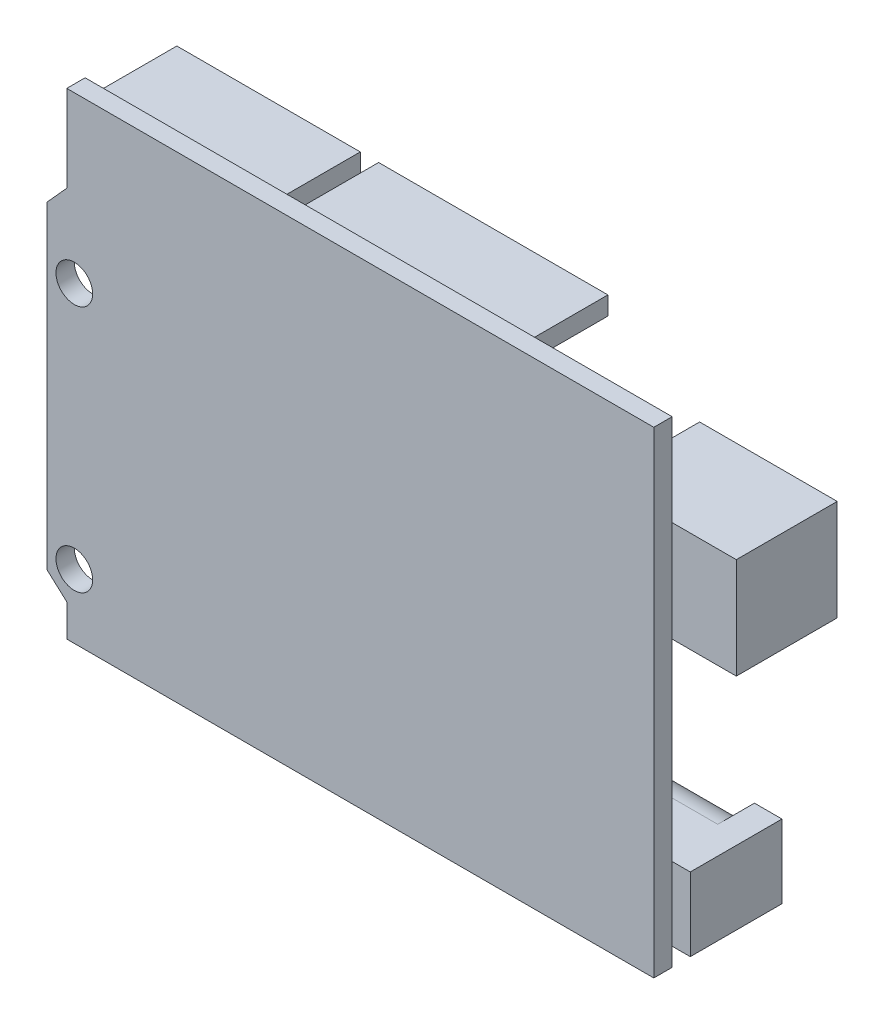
from build123d import *

# Parameters (mm, degrees)
ESQUISSE1_W             = 64
ESQUISSE1_H             = 52
BOSS_EXTRU_1_DEPTH      = 2
ESQUISSE2_W             = 15
ESQUISSE2_H             = 11
BOSS_EXTRU_2_DEPTH      = 11
ESQUISSE3_W             = 20
ESQUISSE3_H             = 2
ESQUISSE3_W_2           = 25
ESQUISSE3_W_3           = 15
BOSS_EXTRU_3_DEPTH      = 9
BOSS_EXTRU_4_DEPTH      = 2
ESQUISSE5_R             = 2
ENL_V_MAT_EXTRU_1_DEPTH = 2
ESQUISSE6_W             = 13
ESQUISSE6_H             = 8
BOSS_EXTRU_5_DEPTH      = 10
ENL_V_MAT_EXTRU_2_DEPTH = 10


with BuildPart() as part:
    # Esquisse1 → Boss.-Extru.1 (new body)
    with BuildSketch(Plane.XY):
        with Locations((32, -26)):
            Rectangle(ESQUISSE1_W, ESQUISSE1_H)
    extrude(amount=BOSS_EXTRU_1_DEPTH)

    # Esquisse2 → Boss.-Extru.2 (add)
    with BuildSketch(Plane(origin=(0, 0, 0), x_dir=(-1, 0, 0), z_dir=(0, 0, -1))):
        with Locations((-63.49803953, -15.5)):
            Rectangle(ESQUISSE2_W, ESQUISSE2_H)
    extrude(amount=BOSS_EXTRU_2_DEPTH)

    # Esquisse3 → Boss.-Extru.3 (add)
    with BuildSketch(Plane(origin=(0, 0, 0), x_dir=(-1, 0, 0), z_dir=(0, 0, -1))):
        with Locations((-11, -2)):
            Rectangle(ESQUISSE3_W, ESQUISSE3_H)
        with Locations((-35.5, -2)):
            Rectangle(ESQUISSE3_W_2, ESQUISSE3_H)
        with Locations((-8.5, -50)):
            Rectangle(ESQUISSE3_W_3, ESQUISSE3_H)
        with Locations((-28, -50)):
            Rectangle(ESQUISSE3_W, ESQUISSE3_H)
    extrude(amount=BOSS_EXTRU_3_DEPTH)

    # Esquisse4 → Boss.-Extru.4 (add)
    with BuildSketch(Plane(origin=(0, 0, 0), x_dir=(-1, 0, 0), z_dir=(0, 0, -1))):
        Polygon((0, -48.47924064), (2.17826789, -46.514474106), (2.17826789, -11.842123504), (0, -9.427154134), align=None)
    extrude(amount=-BOSS_EXTRU_4_DEPTH)

    # Esquisse5 → Enl_v. mat.-Extru.1 (cut)
    with BuildSketch(Plane(origin=(0, 0, 0), x_dir=(-1, 0, 0), z_dir=(0, 0, -1))):
        with Locations((-0.82173211, -18)):
            Circle(ESQUISSE5_R)
        with Locations((-0.82173211, -45)):
            Circle(ESQUISSE5_R)
    extrude(amount=-ENL_V_MAT_EXTRU_1_DEPTH, mode=Mode.SUBTRACT)

    # Esquisse6 → Boss.-Extru.5 (add)
    with BuildSketch(Plane(origin=(0, 0, 0), x_dir=(-1, 0, 0), z_dir=(0, 0, -1))):
        with Locations((-59.47679339, -46)):
            Rectangle(ESQUISSE6_W, ESQUISSE6_H)
    extrude(amount=BOSS_EXTRU_5_DEPTH)

    # Esquisse7 → Enl_v. mat.-Extru.2 (cut)
    with BuildSketch(Plane.ZY.offset(-52.97679339)):
        with BuildLine():
            Line((-6, -42), (-6.674319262, -38.7629418))
            Line((-6.674319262, -38.7629418), (-18.371485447, -48.271605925))
            Line((-18.371485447, -48.271605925), (-13.239825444, -51.441160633))
            Line((-13.239825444, -51.441160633), (-6, -50))
            ThreePointArc((-6, -50), (-10, -46), (-6, -42))
        make_face()
    extrude(amount=-ENL_V_MAT_EXTRU_2_DEPTH, mode=Mode.SUBTRACT)


solid = part.part
